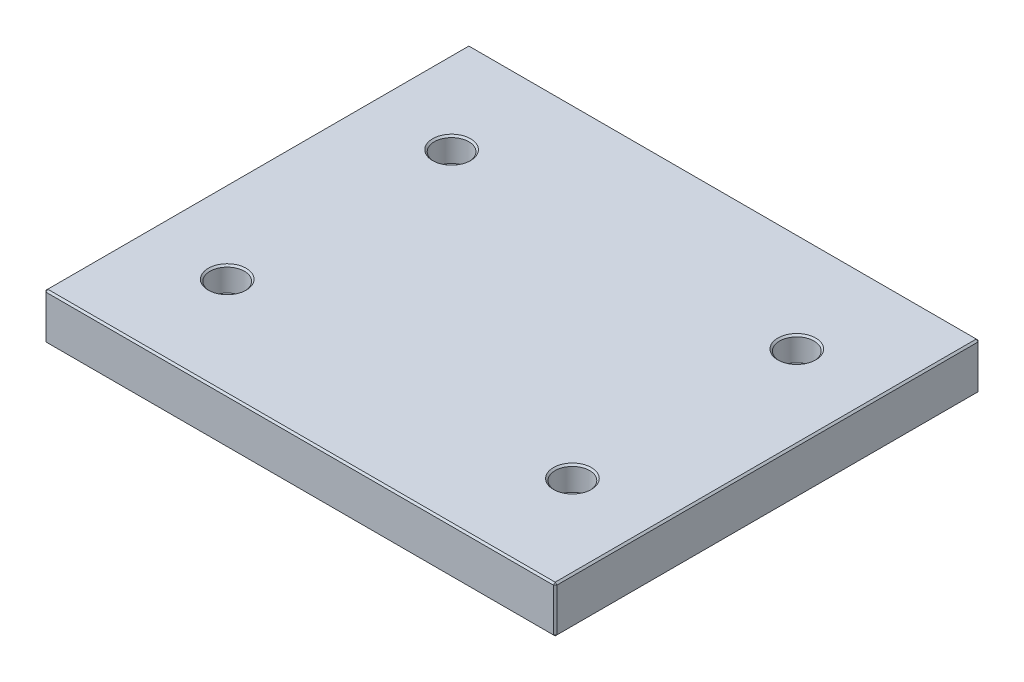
ISO-10303-21;
HEADER;
FILE_DESCRIPTION(('STEP AP214'),'2;1');
FILE_NAME('part.step','',(''),(''),'','','');
FILE_SCHEMA(('AUTOMOTIVE_DESIGN { 1 0 10303 214 1 1 1 1 }'));
ENDSEC;
DATA;
#1=APPLICATION_CONTEXT('core data for automotive mechanical design processes');
#2=APPLICATION_PROTOCOL_DEFINITION('international standard','automotive_design',2000,#1);
#3=PRODUCT_CONTEXT('',#1,'mechanical');
#4=PRODUCT('Part','Part','',(#3));
#5=PRODUCT_RELATED_PRODUCT_CATEGORY('part','',(#4));
#6=PRODUCT_DEFINITION_FORMATION('','',#4);
#7=PRODUCT_DEFINITION_CONTEXT('part definition',#1,'design');
#8=PRODUCT_DEFINITION('design','',#6,#7);
#9=PRODUCT_DEFINITION_SHAPE('','',#8);
#10=(LENGTH_UNIT() NAMED_UNIT(*) SI_UNIT(.MILLI.,.METRE.));
#11=(NAMED_UNIT(*) PLANE_ANGLE_UNIT() SI_UNIT($,.RADIAN.));
#12=(NAMED_UNIT(*) SI_UNIT($,.STERADIAN.) SOLID_ANGLE_UNIT());
#13=UNCERTAINTY_MEASURE_WITH_UNIT(LENGTH_MEASURE(1.E-05),#10,'distance_accuracy_value','');
#14=(GEOMETRIC_REPRESENTATION_CONTEXT(3) GLOBAL_UNCERTAINTY_ASSIGNED_CONTEXT((#13)) GLOBAL_UNIT_ASSIGNED_CONTEXT((#10,
#11,#12)) REPRESENTATION_CONTEXT('',''));
#15=CARTESIAN_POINT('',(0.,0.,0.));
#16=DIRECTION('',(0.,0.,1.));
#17=DIRECTION('',(1.,0.,0.));
#18=AXIS2_PLACEMENT_3D('',#15,#16,#17);
#19=CARTESIAN_POINT('',(-148.,27.,123.));
#20=DIRECTION('',(1.,0.,0.));
#21=DIRECTION('',(0.,0.,-1.));
#22=AXIS2_PLACEMENT_3D('',#19,#20,#21);
#23=PLANE('',#22);
#24=DIRECTION('',(0.,-1.,0.));
#25=VECTOR('',#24,1.);
#26=CARTESIAN_POINT('',(-148.,27.,-122.));
#27=LINE('',#26,#25);
#28=CARTESIAN_POINT('',(-148.,26.,-122.));
#29=VERTEX_POINT('',#28);
#30=CARTESIAN_POINT('',(-148.,1.,-122.));
#31=VERTEX_POINT('',#30);
#32=EDGE_CURVE('E115',#29,#31,#27,.T.);
#33=ORIENTED_EDGE('',*,*,#32,.T.);
#34=DIRECTION('',(0.,0.,1.));
#35=VECTOR('',#34,1.);
#36=CARTESIAN_POINT('',(-148.,1.,123.));
#37=LINE('',#36,#35);
#38=CARTESIAN_POINT('',(-148.,1.,122.));
#39=VERTEX_POINT('',#38);
#40=EDGE_CURVE('E111',#31,#39,#37,.T.);
#41=ORIENTED_EDGE('',*,*,#40,.T.);
#42=DIRECTION('',(0.,1.,0.));
#43=VECTOR('',#42,1.);
#44=CARTESIAN_POINT('',(-148.,27.,122.));
#45=LINE('',#44,#43);
#46=CARTESIAN_POINT('',(-148.,26.,122.));
#47=VERTEX_POINT('',#46);
#48=EDGE_CURVE('E104',#39,#47,#45,.T.);
#49=ORIENTED_EDGE('',*,*,#48,.T.);
#50=DIRECTION('',(0.,0.,-1.));
#51=VECTOR('',#50,1.);
#52=CARTESIAN_POINT('',(-148.,26.,-123.));
#53=LINE('',#52,#51);
#54=EDGE_CURVE('E108',#47,#29,#53,.T.);
#55=ORIENTED_EDGE('',*,*,#54,.T.);
#56=EDGE_LOOP('',(#33,#41,#49,#55));
#57=FACE_BOUND('',#56,.T.);
#58=ADVANCED_FACE('F16',(#57),#23,.F.);
#59=CARTESIAN_POINT('',(148.,27.,123.));
#60=DIRECTION('',(0.,0.,-1.));
#61=DIRECTION('',(-1.,0.,0.));
#62=AXIS2_PLACEMENT_3D('',#59,#60,#61);
#63=PLANE('',#62);
#64=DIRECTION('',(-1.,0.,0.));
#65=VECTOR('',#64,1.);
#66=CARTESIAN_POINT('',(-148.,26.,123.));
#67=LINE('',#66,#65);
#68=CARTESIAN_POINT('',(147.,26.,123.));
#69=VERTEX_POINT('',#68);
#70=CARTESIAN_POINT('',(-147.,26.,123.));
#71=VERTEX_POINT('',#70);
#72=EDGE_CURVE('E170',#69,#71,#67,.T.);
#73=ORIENTED_EDGE('',*,*,#72,.T.);
#74=DIRECTION('',(0.,-1.,0.));
#75=VECTOR('',#74,1.);
#76=CARTESIAN_POINT('',(-147.,27.,123.));
#77=LINE('',#76,#75);
#78=CARTESIAN_POINT('',(-147.,1.,123.));
#79=VERTEX_POINT('',#78);
#80=EDGE_CURVE('E123',#71,#79,#77,.T.);
#81=ORIENTED_EDGE('',*,*,#80,.T.);
#82=DIRECTION('',(1.,0.,0.));
#83=VECTOR('',#82,1.);
#84=CARTESIAN_POINT('',(148.,1.,123.));
#85=LINE('',#84,#83);
#86=CARTESIAN_POINT('',(147.,1.,123.));
#87=VERTEX_POINT('',#86);
#88=EDGE_CURVE('E174',#79,#87,#85,.T.);
#89=ORIENTED_EDGE('',*,*,#88,.T.);
#90=DIRECTION('',(0.,1.,0.));
#91=VECTOR('',#90,1.);
#92=CARTESIAN_POINT('',(147.,27.,123.));
#93=LINE('',#92,#91);
#94=EDGE_CURVE('E172',#87,#69,#93,.T.);
#95=ORIENTED_EDGE('',*,*,#94,.T.);
#96=EDGE_LOOP('',(#73,#81,#89,#95));
#97=FACE_BOUND('',#96,.T.);
#98=ADVANCED_FACE('F317',(#97),#63,.F.);
#99=CARTESIAN_POINT('',(148.,27.,123.));
#100=DIRECTION('',(-1.,0.,0.));
#101=DIRECTION('',(0.,0.,1.));
#102=AXIS2_PLACEMENT_3D('',#99,#100,#101);
#103=PLANE('',#102);
#104=DIRECTION('',(0.,0.,-1.));
#105=VECTOR('',#104,1.);
#106=CARTESIAN_POINT('',(148.,1.,123.));
#107=LINE('',#106,#105);
#108=CARTESIAN_POINT('',(148.,1.,122.));
#109=VERTEX_POINT('',#108);
#110=CARTESIAN_POINT('',(148.,1.,-122.));
#111=VERTEX_POINT('',#110);
#112=EDGE_CURVE('E165',#109,#111,#107,.T.);
#113=ORIENTED_EDGE('',*,*,#112,.T.);
#114=DIRECTION('',(0.,1.,0.));
#115=VECTOR('',#114,1.);
#116=CARTESIAN_POINT('',(148.,27.,-122.));
#117=LINE('',#116,#115);
#118=CARTESIAN_POINT('',(148.,26.,-122.));
#119=VERTEX_POINT('',#118);
#120=EDGE_CURVE('E167',#111,#119,#117,.T.);
#121=ORIENTED_EDGE('',*,*,#120,.T.);
#122=DIRECTION('',(0.,0.,1.));
#123=VECTOR('',#122,1.);
#124=CARTESIAN_POINT('',(148.,26.,123.));
#125=LINE('',#124,#123);
#126=CARTESIAN_POINT('',(148.,26.,122.));
#127=VERTEX_POINT('',#126);
#128=EDGE_CURVE('E161',#119,#127,#125,.T.);
#129=ORIENTED_EDGE('',*,*,#128,.T.);
#130=DIRECTION('',(0.,-1.,0.));
#131=VECTOR('',#130,1.);
#132=CARTESIAN_POINT('',(148.,27.,122.));
#133=LINE('',#132,#131);
#134=EDGE_CURVE('E163',#127,#109,#133,.T.);
#135=ORIENTED_EDGE('',*,*,#134,.T.);
#136=EDGE_LOOP('',(#113,#121,#129,#135));
#137=FACE_BOUND('',#136,.T.);
#138=ADVANCED_FACE('F323',(#137),#103,.F.);
#139=CARTESIAN_POINT('',(148.,27.,-123.));
#140=DIRECTION('',(0.,0.,1.));
#141=DIRECTION('',(1.,0.,0.));
#142=AXIS2_PLACEMENT_3D('',#139,#140,#141);
#143=PLANE('',#142);
#144=DIRECTION('',(0.,-1.,0.));
#145=VECTOR('',#144,1.);
#146=CARTESIAN_POINT('',(147.,27.,-123.));
#147=LINE('',#146,#145);
#148=CARTESIAN_POINT('',(147.,26.,-123.));
#149=VERTEX_POINT('',#148);
#150=CARTESIAN_POINT('',(147.,1.,-123.));
#151=VERTEX_POINT('',#150);
#152=EDGE_CURVE('E154',#149,#151,#147,.T.);
#153=ORIENTED_EDGE('',*,*,#152,.T.);
#154=DIRECTION('',(-1.,0.,0.));
#155=VECTOR('',#154,1.);
#156=CARTESIAN_POINT('',(148.,1.,-123.));
#157=LINE('',#156,#155);
#158=CARTESIAN_POINT('',(-147.,1.,-123.));
#159=VERTEX_POINT('',#158);
#160=EDGE_CURVE('E159',#151,#159,#157,.T.);
#161=ORIENTED_EDGE('',*,*,#160,.T.);
#162=DIRECTION('',(0.,1.,0.));
#163=VECTOR('',#162,1.);
#164=CARTESIAN_POINT('',(-147.,27.,-123.));
#165=LINE('',#164,#163);
#166=CARTESIAN_POINT('',(-147.,26.,-123.));
#167=VERTEX_POINT('',#166);
#168=EDGE_CURVE('E156',#159,#167,#165,.T.);
#169=ORIENTED_EDGE('',*,*,#168,.T.);
#170=DIRECTION('',(1.,0.,0.));
#171=VECTOR('',#170,1.);
#172=CARTESIAN_POINT('',(148.,26.,-123.));
#173=LINE('',#172,#171);
#174=EDGE_CURVE('E152',#167,#149,#173,.T.);
#175=ORIENTED_EDGE('',*,*,#174,.T.);
#176=EDGE_LOOP('',(#153,#161,#169,#175));
#177=FACE_BOUND('',#176,.T.);
#178=ADVANCED_FACE('F465',(#177),#143,.F.);
#179=CARTESIAN_POINT('',(0.,27.,0.));
#180=DIRECTION('',(0.,1.,0.));
#181=DIRECTION('',(0.,0.,1.));
#182=AXIS2_PLACEMENT_3D('',#179,#180,#181);
#183=PLANE('',#182);
#184=CARTESIAN_POINT('',(-100.,27.,65.));
#185=DIRECTION('',(0.,1.,0.));
#186=DIRECTION('',(0.,0.,1.));
#187=AXIS2_PLACEMENT_3D('',#184,#185,#186);
#188=CIRCLE('',#187,11.);
#189=CARTESIAN_POINT('',(-100.,27.,76.));
#190=VERTEX_POINT('',#189);
#191=EDGE_CURVE('E290',#190,#190,#188,.F.);
#192=ORIENTED_EDGE('',*,*,#191,.T.);
#193=EDGE_LOOP('',(#192));
#194=FACE_BOUND('',#193,.T.);
#195=CARTESIAN_POINT('',(100.,27.,65.));
#196=DIRECTION('',(0.,1.,0.));
#197=DIRECTION('',(0.,0.,1.));
#198=AXIS2_PLACEMENT_3D('',#195,#196,#197);
#199=CIRCLE('',#198,11.);
#200=CARTESIAN_POINT('',(100.,27.,76.));
#201=VERTEX_POINT('',#200);
#202=EDGE_CURVE('E287',#201,#201,#199,.F.);
#203=ORIENTED_EDGE('',*,*,#202,.T.);
#204=EDGE_LOOP('',(#203));
#205=FACE_BOUND('',#204,.T.);
#206=CARTESIAN_POINT('',(100.,27.,-65.));
#207=DIRECTION('',(0.,1.,0.));
#208=DIRECTION('',(0.,0.,1.));
#209=AXIS2_PLACEMENT_3D('',#206,#207,#208);
#210=CIRCLE('',#209,11.);
#211=CARTESIAN_POINT('',(100.,27.,-54.));
#212=VERTEX_POINT('',#211);
#213=EDGE_CURVE('E284',#212,#212,#210,.F.);
#214=ORIENTED_EDGE('',*,*,#213,.T.);
#215=EDGE_LOOP('',(#214));
#216=FACE_BOUND('',#215,.T.);
#217=CARTESIAN_POINT('',(-100.,27.,-65.));
#218=DIRECTION('',(0.,1.,0.));
#219=DIRECTION('',(0.,0.,1.));
#220=AXIS2_PLACEMENT_3D('',#217,#218,#219);
#221=CIRCLE('',#220,11.);
#222=CARTESIAN_POINT('',(-100.,27.,-54.));
#223=VERTEX_POINT('',#222);
#224=EDGE_CURVE('E281',#223,#223,#221,.F.);
#225=ORIENTED_EDGE('',*,*,#224,.T.);
#226=EDGE_LOOP('',(#225));
#227=FACE_BOUND('',#226,.T.);
#228=DIRECTION('',(0.,0.,-1.));
#229=VECTOR('',#228,1.);
#230=CARTESIAN_POINT('',(147.,27.,-123.));
#231=LINE('',#230,#229);
#232=CARTESIAN_POINT('',(147.,27.,122.));
#233=VERTEX_POINT('',#232);
#234=CARTESIAN_POINT('',(147.,27.,-122.));
#235=VERTEX_POINT('',#234);
#236=EDGE_CURVE('E31',#233,#235,#231,.T.);
#237=ORIENTED_EDGE('',*,*,#236,.T.);
#238=DIRECTION('',(-1.,0.,0.));
#239=VECTOR('',#238,1.);
#240=CARTESIAN_POINT('',(-148.,27.,-122.));
#241=LINE('',#240,#239);
#242=CARTESIAN_POINT('',(-147.,27.,-122.));
#243=VERTEX_POINT('',#242);
#244=EDGE_CURVE('E190',#235,#243,#241,.T.);
#245=ORIENTED_EDGE('',*,*,#244,.T.);
#246=DIRECTION('',(0.,0.,1.));
#247=VECTOR('',#246,1.);
#248=CARTESIAN_POINT('',(-147.,27.,123.));
#249=LINE('',#248,#247);
#250=CARTESIAN_POINT('',(-147.,27.,122.));
#251=VERTEX_POINT('',#250);
#252=EDGE_CURVE('E186',#243,#251,#249,.T.);
#253=ORIENTED_EDGE('',*,*,#252,.T.);
#254=DIRECTION('',(1.,0.,0.));
#255=VECTOR('',#254,1.);
#256=CARTESIAN_POINT('',(148.,27.,122.));
#257=LINE('',#256,#255);
#258=EDGE_CURVE('E36',#251,#233,#257,.T.);
#259=ORIENTED_EDGE('',*,*,#258,.T.);
#260=EDGE_LOOP('',(#237,#245,#253,#259));
#261=FACE_BOUND('',#260,.T.);
#262=ADVANCED_FACE('F462',(#194,#205,#216,#227,#261),#183,.T.);
#263=CARTESIAN_POINT('',(0.,0.,0.));
#264=DIRECTION('',(0.,1.,0.));
#265=DIRECTION('',(0.,0.,1.));
#266=AXIS2_PLACEMENT_3D('',#263,#264,#265);
#267=PLANE('',#266);
#268=CARTESIAN_POINT('',(100.,0.,-65.));
#269=DIRECTION('',(0.,1.,0.));
#270=DIRECTION('',(0.,0.,1.));
#271=AXIS2_PLACEMENT_3D('',#268,#269,#270);
#272=CIRCLE('',#271,8.);
#273=CARTESIAN_POINT('',(100.,0.,-57.));
#274=VERTEX_POINT('',#273);
#275=EDGE_CURVE('E263',#274,#274,#272,.T.);
#276=ORIENTED_EDGE('',*,*,#275,.T.);
#277=EDGE_LOOP('',(#276));
#278=FACE_BOUND('',#277,.T.);
#279=CARTESIAN_POINT('',(100.,0.,65.));
#280=DIRECTION('',(0.,1.,0.));
#281=DIRECTION('',(0.,0.,1.));
#282=AXIS2_PLACEMENT_3D('',#279,#280,#281);
#283=CIRCLE('',#282,8.);
#284=CARTESIAN_POINT('',(100.,0.,73.));
#285=VERTEX_POINT('',#284);
#286=EDGE_CURVE('E260',#285,#285,#283,.T.);
#287=ORIENTED_EDGE('',*,*,#286,.T.);
#288=EDGE_LOOP('',(#287));
#289=FACE_BOUND('',#288,.T.);
#290=CARTESIAN_POINT('',(-100.,0.,65.));
#291=DIRECTION('',(0.,1.,0.));
#292=DIRECTION('',(0.,0.,1.));
#293=AXIS2_PLACEMENT_3D('',#290,#291,#292);
#294=CIRCLE('',#293,8.);
#295=CARTESIAN_POINT('',(-100.,0.,73.));
#296=VERTEX_POINT('',#295);
#297=EDGE_CURVE('E257',#296,#296,#294,.T.);
#298=ORIENTED_EDGE('',*,*,#297,.T.);
#299=EDGE_LOOP('',(#298));
#300=FACE_BOUND('',#299,.T.);
#301=CARTESIAN_POINT('',(-100.,0.,-65.));
#302=DIRECTION('',(0.,1.,0.));
#303=DIRECTION('',(0.,0.,1.));
#304=AXIS2_PLACEMENT_3D('',#301,#302,#303);
#305=CIRCLE('',#304,8.);
#306=CARTESIAN_POINT('',(-100.,0.,-57.));
#307=VERTEX_POINT('',#306);
#308=EDGE_CURVE('E192',#307,#307,#305,.T.);
#309=ORIENTED_EDGE('',*,*,#308,.T.);
#310=EDGE_LOOP('',(#309));
#311=FACE_BOUND('',#310,.T.);
#312=DIRECTION('',(0.,0.,1.));
#313=VECTOR('',#312,1.);
#314=CARTESIAN_POINT('',(147.,0.,0.));
#315=LINE('',#314,#313);
#316=CARTESIAN_POINT('',(147.,0.,-122.));
#317=VERTEX_POINT('',#316);
#318=CARTESIAN_POINT('',(147.,0.,122.));
#319=VERTEX_POINT('',#318);
#320=EDGE_CURVE('E177',#317,#319,#315,.T.);
#321=ORIENTED_EDGE('',*,*,#320,.T.);
#322=DIRECTION('',(-1.,0.,0.));
#323=VECTOR('',#322,1.);
#324=CARTESIAN_POINT('',(0.,0.,122.));
#325=LINE('',#324,#323);
#326=CARTESIAN_POINT('',(-147.,0.,122.));
#327=VERTEX_POINT('',#326);
#328=EDGE_CURVE('E183',#319,#327,#325,.T.);
#329=ORIENTED_EDGE('',*,*,#328,.T.);
#330=DIRECTION('',(0.,0.,-1.));
#331=VECTOR('',#330,1.);
#332=CARTESIAN_POINT('',(-147.,0.,0.));
#333=LINE('',#332,#331);
#334=CARTESIAN_POINT('',(-147.,0.,-122.));
#335=VERTEX_POINT('',#334);
#336=EDGE_CURVE('E181',#327,#335,#333,.T.);
#337=ORIENTED_EDGE('',*,*,#336,.T.);
#338=DIRECTION('',(1.,0.,0.));
#339=VECTOR('',#338,1.);
#340=CARTESIAN_POINT('',(0.,0.,-122.));
#341=LINE('',#340,#339);
#342=EDGE_CURVE('E179',#335,#317,#341,.T.);
#343=ORIENTED_EDGE('',*,*,#342,.T.);
#344=EDGE_LOOP('',(#321,#329,#337,#343));
#345=FACE_BOUND('',#344,.T.);
#346=ADVANCED_FACE('F402',(#278,#289,#300,#311,#345),#267,.F.);
#347=CARTESIAN_POINT('',(148.,27.,122.));
#348=DIRECTION('',(-0.707106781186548,0.,-0.707106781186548));
#349=DIRECTION('',(0.,-1.,0.));
#350=AXIS2_PLACEMENT_3D('',#347,#348,#349);
#351=PLANE('',#350);
#352=DIRECTION('',(-0.707106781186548,0.,0.707106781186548));
#353=VECTOR('',#352,1.);
#354=CARTESIAN_POINT('',(147.,26.,123.));
#355=LINE('',#354,#353);
#356=EDGE_CURVE('E141',#69,#127,#355,.F.);
#357=ORIENTED_EDGE('',*,*,#356,.F.);
#358=ORIENTED_EDGE('',*,*,#94,.F.);
#359=DIRECTION('',(0.707106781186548,0.,-0.707106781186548));
#360=VECTOR('',#359,1.);
#361=CARTESIAN_POINT('',(147.,1.,123.));
#362=LINE('',#361,#360);
#363=EDGE_CURVE('E144',#109,#87,#362,.F.);
#364=ORIENTED_EDGE('',*,*,#363,.F.);
#365=ORIENTED_EDGE('',*,*,#134,.F.);
#366=EDGE_LOOP('',(#357,#358,#364,#365));
#367=FACE_BOUND('',#366,.T.);
#368=ADVANCED_FACE('F398',(#367),#351,.F.);
#369=CARTESIAN_POINT('',(147.,26.,123.));
#370=DIRECTION('',(0.577350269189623,0.577350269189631,0.577350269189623));
#371=DIRECTION('',(0.,-0.707106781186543,0.707106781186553));
#372=AXIS2_PLACEMENT_3D('',#369,#370,#371);
#373=PLANE('',#372);
#374=DIRECTION('',(0.,-0.70710678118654,0.707106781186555));
#375=VECTOR('',#374,1.);
#376=CARTESIAN_POINT('',(147.,26.,123.));
#377=LINE('',#376,#375);
#378=EDGE_CURVE('E235',#69,#233,#377,.F.);
#379=ORIENTED_EDGE('',*,*,#378,.F.);
#380=ORIENTED_EDGE('',*,*,#356,.T.);
#381=DIRECTION('',(-0.707106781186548,0.707106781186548,0.));
#382=VECTOR('',#381,1.);
#383=CARTESIAN_POINT('',(147.5,26.5,122.));
#384=LINE('',#383,#382);
#385=EDGE_CURVE('E237',#233,#127,#384,.F.);
#386=ORIENTED_EDGE('',*,*,#385,.F.);
#387=EDGE_LOOP('',(#379,#380,#386));
#388=FACE_BOUND('',#387,.T.);
#389=ADVANCED_FACE('F394',(#388),#373,.T.);
#390=CARTESIAN_POINT('',(147.,1.,123.));
#391=DIRECTION('',(0.577350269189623,-0.577350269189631,0.577350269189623));
#392=DIRECTION('',(0.,-0.707106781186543,-0.707106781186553));
#393=AXIS2_PLACEMENT_3D('',#390,#391,#392);
#394=PLANE('',#393);
#395=DIRECTION('',(-0.707106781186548,-0.707106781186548,0.));
#396=VECTOR('',#395,1.);
#397=CARTESIAN_POINT('',(147.5,0.500000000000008,122.));
#398=LINE('',#397,#396);
#399=EDGE_CURVE('E229',#109,#319,#398,.T.);
#400=ORIENTED_EDGE('',*,*,#399,.F.);
#401=ORIENTED_EDGE('',*,*,#363,.T.);
#402=DIRECTION('',(0.,0.70710678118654,0.707106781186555));
#403=VECTOR('',#402,1.);
#404=CARTESIAN_POINT('',(147.,1.,123.));
#405=LINE('',#404,#403);
#406=EDGE_CURVE('E232',#319,#87,#405,.T.);
#407=ORIENTED_EDGE('',*,*,#406,.F.);
#408=EDGE_LOOP('',(#400,#401,#407));
#409=FACE_BOUND('',#408,.T.);
#410=ADVANCED_FACE('F390',(#409),#394,.T.);
#411=CARTESIAN_POINT('',(147.,27.,0.));
#412=DIRECTION('',(0.707106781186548,0.707106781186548,0.));
#413=DIRECTION('',(0.,0.,1.));
#414=AXIS2_PLACEMENT_3D('',#411,#412,#413);
#415=PLANE('',#414);
#416=ORIENTED_EDGE('',*,*,#385,.T.);
#417=ORIENTED_EDGE('',*,*,#128,.F.);
#418=DIRECTION('',(0.707106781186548,-0.707106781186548,0.));
#419=VECTOR('',#418,1.);
#420=CARTESIAN_POINT('',(148.,26.,-122.));
#421=LINE('',#420,#419);
#422=EDGE_CURVE('E224',#235,#119,#421,.T.);
#423=ORIENTED_EDGE('',*,*,#422,.F.);
#424=ORIENTED_EDGE('',*,*,#236,.F.);
#425=EDGE_LOOP('',(#416,#417,#423,#424));
#426=FACE_BOUND('',#425,.T.);
#427=ADVANCED_FACE('F386',(#426),#415,.T.);
#428=CARTESIAN_POINT('',(0.,27.,122.));
#429=DIRECTION('',(0.,0.707106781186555,0.70710678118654));
#430=DIRECTION('',(-1.,0.,0.));
#431=AXIS2_PLACEMENT_3D('',#428,#429,#430);
#432=PLANE('',#431);
#433=ORIENTED_EDGE('',*,*,#378,.T.);
#434=ORIENTED_EDGE('',*,*,#258,.F.);
#435=DIRECTION('',(0.,0.70710678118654,-0.707106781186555));
#436=VECTOR('',#435,1.);
#437=CARTESIAN_POINT('',(-147.,26.5,122.5));
#438=LINE('',#437,#436);
#439=EDGE_CURVE('E127',#71,#251,#438,.T.);
#440=ORIENTED_EDGE('',*,*,#439,.F.);
#441=ORIENTED_EDGE('',*,*,#72,.F.);
#442=EDGE_LOOP('',(#433,#434,#440,#441));
#443=FACE_BOUND('',#442,.T.);
#444=ADVANCED_FACE('F383',(#443),#432,.T.);
#445=CARTESIAN_POINT('',(-147.,27.,123.));
#446=DIRECTION('',(0.707106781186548,0.,-0.707106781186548));
#447=DIRECTION('',(0.,-1.,0.));
#448=AXIS2_PLACEMENT_3D('',#445,#446,#447);
#449=PLANE('',#448);
#450=DIRECTION('',(0.707106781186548,0.,0.707106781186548));
#451=VECTOR('',#450,1.);
#452=CARTESIAN_POINT('',(-147.,1.,123.));
#453=LINE('',#452,#451);
#454=EDGE_CURVE('E128',#79,#39,#453,.F.);
#455=ORIENTED_EDGE('',*,*,#454,.F.);
#456=ORIENTED_EDGE('',*,*,#80,.F.);
#457=DIRECTION('',(-0.707106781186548,0.,-0.707106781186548));
#458=VECTOR('',#457,1.);
#459=CARTESIAN_POINT('',(-148.,26.,122.));
#460=LINE('',#459,#458);
#461=EDGE_CURVE('E119',#47,#71,#460,.F.);
#462=ORIENTED_EDGE('',*,*,#461,.F.);
#463=ORIENTED_EDGE('',*,*,#48,.F.);
#464=EDGE_LOOP('',(#455,#456,#462,#463));
#465=FACE_BOUND('',#464,.T.);
#466=ADVANCED_FACE('F121',(#465),#449,.F.);
#467=CARTESIAN_POINT('',(148.,1.,123.));
#468=DIRECTION('',(0.,0.707106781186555,-0.70710678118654));
#469=DIRECTION('',(1.,0.,0.));
#470=AXIS2_PLACEMENT_3D('',#467,#468,#469);
#471=PLANE('',#470);
#472=ORIENTED_EDGE('',*,*,#406,.T.);
#473=ORIENTED_EDGE('',*,*,#88,.F.);
#474=DIRECTION('',(0.,-0.70710678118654,-0.707106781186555));
#475=VECTOR('',#474,1.);
#476=CARTESIAN_POINT('',(-147.,1.,123.));
#477=LINE('',#476,#475);
#478=EDGE_CURVE('E220',#327,#79,#477,.F.);
#479=ORIENTED_EDGE('',*,*,#478,.F.);
#480=ORIENTED_EDGE('',*,*,#328,.F.);
#481=EDGE_LOOP('',(#472,#473,#479,#480));
#482=FACE_BOUND('',#481,.T.);
#483=ADVANCED_FACE('F376',(#482),#471,.F.);
#484=CARTESIAN_POINT('',(148.,1.,123.));
#485=DIRECTION('',(-0.707106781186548,0.707106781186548,0.));
#486=DIRECTION('',(0.,0.,-1.));
#487=AXIS2_PLACEMENT_3D('',#484,#485,#486);
#488=PLANE('',#487);
#489=ORIENTED_EDGE('',*,*,#399,.T.);
#490=ORIENTED_EDGE('',*,*,#320,.F.);
#491=DIRECTION('',(0.707106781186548,0.707106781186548,0.));
#492=VECTOR('',#491,1.);
#493=CARTESIAN_POINT('',(147.5,0.499999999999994,-122.));
#494=LINE('',#493,#492);
#495=EDGE_CURVE('E217',#111,#317,#494,.F.);
#496=ORIENTED_EDGE('',*,*,#495,.F.);
#497=ORIENTED_EDGE('',*,*,#112,.F.);
#498=EDGE_LOOP('',(#489,#490,#496,#497));
#499=FACE_BOUND('',#498,.T.);
#500=ADVANCED_FACE('F372',(#499),#488,.F.);
#501=CARTESIAN_POINT('',(147.,27.,-123.));
#502=DIRECTION('',(-0.707106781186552,0.,0.707106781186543));
#503=DIRECTION('',(0.,-1.,0.));
#504=AXIS2_PLACEMENT_3D('',#501,#502,#503);
#505=PLANE('',#504);
#506=DIRECTION('',(0.707106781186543,0.,0.707106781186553));
#507=VECTOR('',#506,1.);
#508=CARTESIAN_POINT('',(148.,26.,-122.));
#509=LINE('',#508,#507);
#510=EDGE_CURVE('E226',#119,#149,#509,.F.);
#511=ORIENTED_EDGE('',*,*,#510,.F.);
#512=ORIENTED_EDGE('',*,*,#120,.F.);
#513=DIRECTION('',(-0.707106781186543,0.,-0.707106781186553));
#514=VECTOR('',#513,1.);
#515=CARTESIAN_POINT('',(147.,1.,-123.));
#516=LINE('',#515,#514);
#517=EDGE_CURVE('E214',#151,#111,#516,.F.);
#518=ORIENTED_EDGE('',*,*,#517,.F.);
#519=ORIENTED_EDGE('',*,*,#152,.F.);
#520=EDGE_LOOP('',(#511,#512,#518,#519));
#521=FACE_BOUND('',#520,.T.);
#522=ADVANCED_FACE('F368',(#521),#505,.F.);
#523=CARTESIAN_POINT('',(148.,26.,-122.));
#524=DIRECTION('',(0.577350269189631,0.577350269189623,-0.577350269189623));
#525=DIRECTION('',(-0.707106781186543,0.,-0.707106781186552));
#526=AXIS2_PLACEMENT_3D('',#523,#524,#525);
#527=PLANE('',#526);
#528=ORIENTED_EDGE('',*,*,#422,.T.);
#529=ORIENTED_EDGE('',*,*,#510,.T.);
#530=DIRECTION('',(0.,0.707106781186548,0.707106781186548));
#531=VECTOR('',#530,1.);
#532=CARTESIAN_POINT('',(147.,26.5,-122.5));
#533=LINE('',#532,#531);
#534=EDGE_CURVE('E135',#235,#149,#533,.F.);
#535=ORIENTED_EDGE('',*,*,#534,.F.);
#536=EDGE_LOOP('',(#528,#529,#535));
#537=FACE_BOUND('',#536,.T.);
#538=ADVANCED_FACE('F365',(#537),#527,.T.);
#539=CARTESIAN_POINT('',(-148.,26.,122.));
#540=DIRECTION('',(-0.577350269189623,0.577350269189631,0.577350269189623));
#541=DIRECTION('',(0.,-0.707106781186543,0.707106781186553));
#542=AXIS2_PLACEMENT_3D('',#539,#540,#541);
#543=PLANE('',#542);
#544=ORIENTED_EDGE('',*,*,#461,.T.);
#545=ORIENTED_EDGE('',*,*,#439,.T.);
#546=DIRECTION('',(-0.707106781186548,-0.707106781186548,0.));
#547=VECTOR('',#546,1.);
#548=CARTESIAN_POINT('',(-148.,26.,122.));
#549=LINE('',#548,#547);
#550=EDGE_CURVE('E131',#47,#251,#549,.F.);
#551=ORIENTED_EDGE('',*,*,#550,.F.);
#552=EDGE_LOOP('',(#544,#545,#551));
#553=FACE_BOUND('',#552,.T.);
#554=ADVANCED_FACE('F132',(#553),#543,.T.);
#555=CARTESIAN_POINT('',(-147.,1.,123.));
#556=DIRECTION('',(-0.577350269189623,-0.577350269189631,0.577350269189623));
#557=DIRECTION('',(0.,-0.707106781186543,-0.707106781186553));
#558=AXIS2_PLACEMENT_3D('',#555,#556,#557);
#559=PLANE('',#558);
#560=ORIENTED_EDGE('',*,*,#478,.T.);
#561=ORIENTED_EDGE('',*,*,#454,.T.);
#562=DIRECTION('',(-0.707106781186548,0.707106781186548,0.));
#563=VECTOR('',#562,1.);
#564=CARTESIAN_POINT('',(-147.5,0.500000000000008,122.));
#565=LINE('',#564,#563);
#566=EDGE_CURVE('E136',#327,#39,#565,.T.);
#567=ORIENTED_EDGE('',*,*,#566,.F.);
#568=EDGE_LOOP('',(#560,#561,#567));
#569=FACE_BOUND('',#568,.T.);
#570=ADVANCED_FACE('F358',(#569),#559,.T.);
#571=CARTESIAN_POINT('',(147.,1.,-123.));
#572=DIRECTION('',(0.577350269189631,-0.577350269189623,-0.577350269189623));
#573=DIRECTION('',(-0.707106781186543,0.,-0.707106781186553));
#574=AXIS2_PLACEMENT_3D('',#571,#572,#573);
#575=PLANE('',#574);
#576=ORIENTED_EDGE('',*,*,#517,.T.);
#577=ORIENTED_EDGE('',*,*,#495,.T.);
#578=DIRECTION('',(0.,-0.707106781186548,0.707106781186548));
#579=VECTOR('',#578,1.);
#580=CARTESIAN_POINT('',(147.,1.,-123.));
#581=LINE('',#580,#579);
#582=EDGE_CURVE('E207',#151,#317,#581,.T.);
#583=ORIENTED_EDGE('',*,*,#582,.F.);
#584=EDGE_LOOP('',(#576,#577,#583));
#585=FACE_BOUND('',#584,.T.);
#586=ADVANCED_FACE('F354',(#585),#575,.T.);
#587=CARTESIAN_POINT('',(0.,27.,-122.));
#588=DIRECTION('',(0.,0.707106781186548,-0.707106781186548));
#589=DIRECTION('',(1.,0.,0.));
#590=AXIS2_PLACEMENT_3D('',#587,#588,#589);
#591=PLANE('',#590);
#592=ORIENTED_EDGE('',*,*,#534,.T.);
#593=ORIENTED_EDGE('',*,*,#174,.F.);
#594=DIRECTION('',(0.,-0.707106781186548,-0.707106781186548));
#595=VECTOR('',#594,1.);
#596=CARTESIAN_POINT('',(-147.,26.,-123.));
#597=LINE('',#596,#595);
#598=EDGE_CURVE('E204',#243,#167,#597,.T.);
#599=ORIENTED_EDGE('',*,*,#598,.F.);
#600=ORIENTED_EDGE('',*,*,#244,.F.);
#601=EDGE_LOOP('',(#592,#593,#599,#600));
#602=FACE_BOUND('',#601,.T.);
#603=ADVANCED_FACE('F351',(#602),#591,.T.);
#604=CARTESIAN_POINT('',(-147.,27.,0.));
#605=DIRECTION('',(-0.707106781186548,0.707106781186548,0.));
#606=DIRECTION('',(0.,0.,-1.));
#607=AXIS2_PLACEMENT_3D('',#604,#605,#606);
#608=PLANE('',#607);
#609=ORIENTED_EDGE('',*,*,#550,.T.);
#610=ORIENTED_EDGE('',*,*,#252,.F.);
#611=DIRECTION('',(0.707106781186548,0.707106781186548,0.));
#612=VECTOR('',#611,1.);
#613=CARTESIAN_POINT('',(-147.5,26.5,-122.));
#614=LINE('',#613,#612);
#615=EDGE_CURVE('E139',#29,#243,#614,.T.);
#616=ORIENTED_EDGE('',*,*,#615,.F.);
#617=ORIENTED_EDGE('',*,*,#54,.F.);
#618=EDGE_LOOP('',(#609,#610,#616,#617));
#619=FACE_BOUND('',#618,.T.);
#620=ADVANCED_FACE('F138',(#619),#608,.T.);
#621=CARTESIAN_POINT('',(-148.,1.,123.));
#622=DIRECTION('',(0.707106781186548,0.707106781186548,0.));
#623=DIRECTION('',(0.,0.,1.));
#624=AXIS2_PLACEMENT_3D('',#621,#622,#623);
#625=PLANE('',#624);
#626=ORIENTED_EDGE('',*,*,#566,.T.);
#627=ORIENTED_EDGE('',*,*,#40,.F.);
#628=DIRECTION('',(0.707106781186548,-0.707106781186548,0.));
#629=VECTOR('',#628,1.);
#630=CARTESIAN_POINT('',(-148.,1.,-122.));
#631=LINE('',#630,#629);
#632=EDGE_CURVE('E200',#335,#31,#631,.F.);
#633=ORIENTED_EDGE('',*,*,#632,.F.);
#634=ORIENTED_EDGE('',*,*,#336,.F.);
#635=EDGE_LOOP('',(#626,#627,#633,#634));
#636=FACE_BOUND('',#635,.T.);
#637=ADVANCED_FACE('F344',(#636),#625,.F.);
#638=CARTESIAN_POINT('',(148.,1.,-123.));
#639=DIRECTION('',(0.,0.707106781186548,0.707106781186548));
#640=DIRECTION('',(-1.,0.,0.));
#641=AXIS2_PLACEMENT_3D('',#638,#639,#640);
#642=PLANE('',#641);
#643=ORIENTED_EDGE('',*,*,#582,.T.);
#644=ORIENTED_EDGE('',*,*,#342,.F.);
#645=DIRECTION('',(0.,0.707106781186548,-0.707106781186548));
#646=VECTOR('',#645,1.);
#647=CARTESIAN_POINT('',(-147.,0.5,-122.5));
#648=LINE('',#647,#646);
#649=EDGE_CURVE('E197',#159,#335,#648,.F.);
#650=ORIENTED_EDGE('',*,*,#649,.F.);
#651=ORIENTED_EDGE('',*,*,#160,.F.);
#652=EDGE_LOOP('',(#643,#644,#650,#651));
#653=FACE_BOUND('',#652,.T.);
#654=ADVANCED_FACE('F340',(#653),#642,.F.);
#655=CARTESIAN_POINT('',(-147.,26.,-123.));
#656=DIRECTION('',(-0.577350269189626,0.577350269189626,-0.577350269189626));
#657=DIRECTION('',(-0.707106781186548,0.,0.707106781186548));
#658=AXIS2_PLACEMENT_3D('',#655,#656,#657);
#659=PLANE('',#658);
#660=ORIENTED_EDGE('',*,*,#615,.T.);
#661=ORIENTED_EDGE('',*,*,#598,.T.);
#662=DIRECTION('',(0.707106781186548,0.,-0.707106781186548));
#663=VECTOR('',#662,1.);
#664=CARTESIAN_POINT('',(-147.,26.,-123.));
#665=LINE('',#664,#663);
#666=EDGE_CURVE('E195',#29,#167,#665,.T.);
#667=ORIENTED_EDGE('',*,*,#666,.F.);
#668=EDGE_LOOP('',(#660,#661,#667));
#669=FACE_BOUND('',#668,.T.);
#670=ADVANCED_FACE('F336',(#669),#659,.T.);
#671=CARTESIAN_POINT('',(-148.,1.,-122.));
#672=DIRECTION('',(-0.577350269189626,-0.577350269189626,-0.577350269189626));
#673=DIRECTION('',(-0.707106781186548,0.,0.707106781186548));
#674=AXIS2_PLACEMENT_3D('',#671,#672,#673);
#675=PLANE('',#674);
#676=ORIENTED_EDGE('',*,*,#649,.T.);
#677=ORIENTED_EDGE('',*,*,#632,.T.);
#678=DIRECTION('',(-0.707106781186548,0.,0.707106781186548));
#679=VECTOR('',#678,1.);
#680=CARTESIAN_POINT('',(-148.,1.,-122.));
#681=LINE('',#680,#679);
#682=EDGE_CURVE('E193',#159,#31,#681,.T.);
#683=ORIENTED_EDGE('',*,*,#682,.F.);
#684=EDGE_LOOP('',(#676,#677,#683));
#685=FACE_BOUND('',#684,.T.);
#686=ADVANCED_FACE('F332',(#685),#675,.T.);
#687=CARTESIAN_POINT('',(-148.,27.,-122.));
#688=DIRECTION('',(0.707106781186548,0.,0.707106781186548));
#689=DIRECTION('',(0.,-1.,0.));
#690=AXIS2_PLACEMENT_3D('',#687,#688,#689);
#691=PLANE('',#690);
#692=ORIENTED_EDGE('',*,*,#666,.T.);
#693=ORIENTED_EDGE('',*,*,#168,.F.);
#694=ORIENTED_EDGE('',*,*,#682,.T.);
#695=ORIENTED_EDGE('',*,*,#32,.F.);
#696=EDGE_LOOP('',(#692,#693,#694,#695));
#697=FACE_BOUND('',#696,.T.);
#698=ADVANCED_FACE('F328',(#697),#691,.F.);
#699=CARTESIAN_POINT('',(-100.,13.,-65.));
#700=DIRECTION('',(0.,1.,0.));
#701=DIRECTION('',(0.,0.,1.));
#702=AXIS2_PLACEMENT_3D('',#699,#700,#701);
#703=CYLINDRICAL_SURFACE('',#702,10.);
#704=CARTESIAN_POINT('',(-100.,26.,-65.));
#705=DIRECTION('',(0.,1.,0.));
#706=DIRECTION('',(0.,0.,1.));
#707=AXIS2_PLACEMENT_3D('',#704,#705,#706);
#708=CIRCLE('',#707,10.);
#709=CARTESIAN_POINT('',(-100.,26.,-55.));
#710=VERTEX_POINT('',#709);
#711=EDGE_CURVE('E10',#710,#710,#708,.T.);
#712=ORIENTED_EDGE('',*,*,#711,.T.);
#713=EDGE_LOOP('',(#712));
#714=FACE_BOUND('',#713,.T.);
#715=CARTESIAN_POINT('',(-100.,13.,-65.));
#716=DIRECTION('',(0.,1.,0.));
#717=DIRECTION('',(0.,0.,1.));
#718=AXIS2_PLACEMENT_3D('',#715,#716,#717);
#719=CIRCLE('',#718,10.);
#720=CARTESIAN_POINT('',(-100.,13.,-55.));
#721=VERTEX_POINT('',#720);
#722=EDGE_CURVE('E147',#721,#721,#719,.T.);
#723=ORIENTED_EDGE('',*,*,#722,.F.);
#724=EDGE_LOOP('',(#723));
#725=FACE_BOUND('',#724,.T.);
#726=ADVANCED_FACE('F331',(#714,#725),#703,.F.);
#727=CARTESIAN_POINT('',(-100.,13.,-65.));
#728=DIRECTION('',(0.,1.,0.));
#729=DIRECTION('',(0.,0.,1.));
#730=AXIS2_PLACEMENT_3D('',#727,#728,#729);
#731=PLANE('',#730);
#732=CARTESIAN_POINT('',(-100.,13.,-65.));
#733=DIRECTION('',(0.,1.,0.));
#734=DIRECTION('',(0.,0.,1.));
#735=AXIS2_PLACEMENT_3D('',#732,#733,#734);
#736=CIRCLE('',#735,7.);
#737=CARTESIAN_POINT('',(-100.,13.,-58.));
#738=VERTEX_POINT('',#737);
#739=EDGE_CURVE('E251',#738,#738,#736,.T.);
#740=ORIENTED_EDGE('',*,*,#739,.F.);
#741=EDGE_LOOP('',(#740));
#742=FACE_BOUND('',#741,.T.);
#743=ORIENTED_EDGE('',*,*,#722,.T.);
#744=EDGE_LOOP('',(#743));
#745=FACE_BOUND('',#744,.T.);
#746=ADVANCED_FACE('F450',(#742,#745),#731,.T.);
#747=CARTESIAN_POINT('',(100.,13.,-65.));
#748=DIRECTION('',(0.,1.,0.));
#749=DIRECTION('',(0.,0.,1.));
#750=AXIS2_PLACEMENT_3D('',#747,#748,#749);
#751=CYLINDRICAL_SURFACE('',#750,10.);
#752=CARTESIAN_POINT('',(100.,26.,-65.));
#753=DIRECTION('',(0.,1.,0.));
#754=DIRECTION('',(0.,0.,1.));
#755=AXIS2_PLACEMENT_3D('',#752,#753,#754);
#756=CIRCLE('',#755,10.);
#757=CARTESIAN_POINT('',(100.,26.,-55.));
#758=VERTEX_POINT('',#757);
#759=EDGE_CURVE('E24',#758,#758,#756,.T.);
#760=ORIENTED_EDGE('',*,*,#759,.T.);
#761=EDGE_LOOP('',(#760));
#762=FACE_BOUND('',#761,.T.);
#763=CARTESIAN_POINT('',(100.,13.,-65.));
#764=DIRECTION('',(0.,1.,0.));
#765=DIRECTION('',(0.,0.,1.));
#766=AXIS2_PLACEMENT_3D('',#763,#764,#765);
#767=CIRCLE('',#766,10.);
#768=CARTESIAN_POINT('',(100.,13.,-55.));
#769=VERTEX_POINT('',#768);
#770=EDGE_CURVE('E441',#769,#769,#767,.T.);
#771=ORIENTED_EDGE('',*,*,#770,.F.);
#772=EDGE_LOOP('',(#771));
#773=FACE_BOUND('',#772,.T.);
#774=ADVANCED_FACE('F298',(#762,#773),#751,.F.);
#775=CARTESIAN_POINT('',(100.,13.,-65.));
#776=DIRECTION('',(0.,1.,0.));
#777=DIRECTION('',(0.,0.,1.));
#778=AXIS2_PLACEMENT_3D('',#775,#776,#777);
#779=PLANE('',#778);
#780=CARTESIAN_POINT('',(100.,13.,-65.));
#781=DIRECTION('',(0.,1.,0.));
#782=DIRECTION('',(0.,0.,1.));
#783=AXIS2_PLACEMENT_3D('',#780,#781,#782);
#784=CIRCLE('',#783,7.);
#785=CARTESIAN_POINT('',(100.,13.,-58.));
#786=VERTEX_POINT('',#785);
#787=EDGE_CURVE('E248',#786,#786,#784,.T.);
#788=ORIENTED_EDGE('',*,*,#787,.F.);
#789=EDGE_LOOP('',(#788));
#790=FACE_BOUND('',#789,.T.);
#791=ORIENTED_EDGE('',*,*,#770,.T.);
#792=EDGE_LOOP('',(#791));
#793=FACE_BOUND('',#792,.T.);
#794=ADVANCED_FACE('F738',(#790,#793),#779,.T.);
#795=CARTESIAN_POINT('',(100.,13.,65.));
#796=DIRECTION('',(0.,1.,0.));
#797=DIRECTION('',(0.,0.,1.));
#798=AXIS2_PLACEMENT_3D('',#795,#796,#797);
#799=CYLINDRICAL_SURFACE('',#798,10.);
#800=CARTESIAN_POINT('',(100.,26.,65.));
#801=DIRECTION('',(0.,1.,0.));
#802=DIRECTION('',(0.,0.,1.));
#803=AXIS2_PLACEMENT_3D('',#800,#801,#802);
#804=CIRCLE('',#803,10.);
#805=CARTESIAN_POINT('',(100.,26.,75.));
#806=VERTEX_POINT('',#805);
#807=EDGE_CURVE('E293',#806,#806,#804,.T.);
#808=ORIENTED_EDGE('',*,*,#807,.T.);
#809=EDGE_LOOP('',(#808));
#810=FACE_BOUND('',#809,.T.);
#811=CARTESIAN_POINT('',(100.,13.,65.));
#812=DIRECTION('',(0.,1.,0.));
#813=DIRECTION('',(0.,0.,1.));
#814=AXIS2_PLACEMENT_3D('',#811,#812,#813);
#815=CIRCLE('',#814,10.);
#816=CARTESIAN_POINT('',(100.,13.,75.));
#817=VERTEX_POINT('',#816);
#818=EDGE_CURVE('E439',#817,#817,#815,.T.);
#819=ORIENTED_EDGE('',*,*,#818,.F.);
#820=EDGE_LOOP('',(#819));
#821=FACE_BOUND('',#820,.T.);
#822=ADVANCED_FACE('F730',(#810,#821),#799,.F.);
#823=CARTESIAN_POINT('',(100.,13.,65.));
#824=DIRECTION('',(0.,1.,0.));
#825=DIRECTION('',(0.,0.,1.));
#826=AXIS2_PLACEMENT_3D('',#823,#824,#825);
#827=PLANE('',#826);
#828=CARTESIAN_POINT('',(100.,13.,65.));
#829=DIRECTION('',(0.,1.,0.));
#830=DIRECTION('',(0.,0.,1.));
#831=AXIS2_PLACEMENT_3D('',#828,#829,#830);
#832=CIRCLE('',#831,7.);
#833=CARTESIAN_POINT('',(100.,13.,72.));
#834=VERTEX_POINT('',#833);
#835=EDGE_CURVE('E245',#834,#834,#832,.T.);
#836=ORIENTED_EDGE('',*,*,#835,.F.);
#837=EDGE_LOOP('',(#836));
#838=FACE_BOUND('',#837,.T.);
#839=ORIENTED_EDGE('',*,*,#818,.T.);
#840=EDGE_LOOP('',(#839));
#841=FACE_BOUND('',#840,.T.);
#842=ADVANCED_FACE('F434',(#838,#841),#827,.T.);
#843=CARTESIAN_POINT('',(-100.,13.,65.));
#844=DIRECTION('',(0.,1.,0.));
#845=DIRECTION('',(0.,0.,1.));
#846=AXIS2_PLACEMENT_3D('',#843,#844,#845);
#847=CYLINDRICAL_SURFACE('',#846,10.);
#848=CARTESIAN_POINT('',(-100.,26.,65.));
#849=DIRECTION('',(0.,1.,0.));
#850=DIRECTION('',(0.,0.,1.));
#851=AXIS2_PLACEMENT_3D('',#848,#849,#850);
#852=CIRCLE('',#851,10.);
#853=CARTESIAN_POINT('',(-100.,26.,75.));
#854=VERTEX_POINT('',#853);
#855=EDGE_CURVE('E278',#854,#854,#852,.T.);
#856=ORIENTED_EDGE('',*,*,#855,.T.);
#857=EDGE_LOOP('',(#856));
#858=FACE_BOUND('',#857,.T.);
#859=CARTESIAN_POINT('',(-100.,13.,65.));
#860=DIRECTION('',(0.,1.,0.));
#861=DIRECTION('',(0.,0.,1.));
#862=AXIS2_PLACEMENT_3D('',#859,#860,#861);
#863=CIRCLE('',#862,10.);
#864=CARTESIAN_POINT('',(-100.,13.,75.));
#865=VERTEX_POINT('',#864);
#866=EDGE_CURVE('E254',#865,#865,#863,.T.);
#867=ORIENTED_EDGE('',*,*,#866,.F.);
#868=EDGE_LOOP('',(#867));
#869=FACE_BOUND('',#868,.T.);
#870=ADVANCED_FACE('F430',(#858,#869),#847,.F.);
#871=CARTESIAN_POINT('',(-100.,13.,65.));
#872=DIRECTION('',(0.,1.,0.));
#873=DIRECTION('',(0.,0.,1.));
#874=AXIS2_PLACEMENT_3D('',#871,#872,#873);
#875=PLANE('',#874);
#876=CARTESIAN_POINT('',(-100.,13.,65.));
#877=DIRECTION('',(0.,1.,0.));
#878=DIRECTION('',(0.,0.,1.));
#879=AXIS2_PLACEMENT_3D('',#876,#877,#878);
#880=CIRCLE('',#879,7.);
#881=CARTESIAN_POINT('',(-100.,13.,72.));
#882=VERTEX_POINT('',#881);
#883=EDGE_CURVE('E242',#882,#882,#880,.T.);
#884=ORIENTED_EDGE('',*,*,#883,.F.);
#885=EDGE_LOOP('',(#884));
#886=FACE_BOUND('',#885,.T.);
#887=ORIENTED_EDGE('',*,*,#866,.T.);
#888=EDGE_LOOP('',(#887));
#889=FACE_BOUND('',#888,.T.);
#890=ADVANCED_FACE('F433',(#886,#889),#875,.T.);
#891=CARTESIAN_POINT('',(-100.,0.,65.));
#892=DIRECTION('',(0.,1.,0.));
#893=DIRECTION('',(0.,0.,1.));
#894=AXIS2_PLACEMENT_3D('',#891,#892,#893);
#895=CYLINDRICAL_SURFACE('',#894,7.);
#896=CARTESIAN_POINT('',(-100.,1.0000000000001,65.));
#897=DIRECTION('',(0.,1.,0.));
#898=DIRECTION('',(0.,0.,1.));
#899=AXIS2_PLACEMENT_3D('',#896,#897,#898);
#900=CIRCLE('',#899,7.);
#901=CARTESIAN_POINT('',(-100.,1.0000000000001,72.));
#902=VERTEX_POINT('',#901);
#903=EDGE_CURVE('E272',#902,#902,#900,.F.);
#904=ORIENTED_EDGE('',*,*,#903,.T.);
#905=EDGE_LOOP('',(#904));
#906=FACE_BOUND('',#905,.T.);
#907=ORIENTED_EDGE('',*,*,#883,.T.);
#908=EDGE_LOOP('',(#907));
#909=FACE_BOUND('',#908,.T.);
#910=ADVANCED_FACE('F705',(#906,#909),#895,.F.);
#911=CARTESIAN_POINT('',(100.,0.,65.));
#912=DIRECTION('',(0.,1.,0.));
#913=DIRECTION('',(0.,0.,1.));
#914=AXIS2_PLACEMENT_3D('',#911,#912,#913);
#915=CYLINDRICAL_SURFACE('',#914,7.);
#916=CARTESIAN_POINT('',(100.,1.0000000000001,65.));
#917=DIRECTION('',(0.,1.,0.));
#918=DIRECTION('',(0.,0.,1.));
#919=AXIS2_PLACEMENT_3D('',#916,#917,#918);
#920=CIRCLE('',#919,7.);
#921=CARTESIAN_POINT('',(100.,1.0000000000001,72.));
#922=VERTEX_POINT('',#921);
#923=EDGE_CURVE('E269',#922,#922,#920,.F.);
#924=ORIENTED_EDGE('',*,*,#923,.T.);
#925=EDGE_LOOP('',(#924));
#926=FACE_BOUND('',#925,.T.);
#927=ORIENTED_EDGE('',*,*,#835,.T.);
#928=EDGE_LOOP('',(#927));
#929=FACE_BOUND('',#928,.T.);
#930=ADVANCED_FACE('F697',(#926,#929),#915,.F.);
#931=CARTESIAN_POINT('',(100.,0.,-65.));
#932=DIRECTION('',(0.,1.,0.));
#933=DIRECTION('',(0.,0.,1.));
#934=AXIS2_PLACEMENT_3D('',#931,#932,#933);
#935=CYLINDRICAL_SURFACE('',#934,7.);
#936=CARTESIAN_POINT('',(100.,0.999999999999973,-65.));
#937=DIRECTION('',(0.,1.,0.));
#938=DIRECTION('',(0.,0.,1.));
#939=AXIS2_PLACEMENT_3D('',#936,#937,#938);
#940=CIRCLE('',#939,7.);
#941=CARTESIAN_POINT('',(100.,0.999999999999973,-58.));
#942=VERTEX_POINT('',#941);
#943=EDGE_CURVE('E266',#942,#942,#940,.F.);
#944=ORIENTED_EDGE('',*,*,#943,.T.);
#945=EDGE_LOOP('',(#944));
#946=FACE_BOUND('',#945,.T.);
#947=ORIENTED_EDGE('',*,*,#787,.T.);
#948=EDGE_LOOP('',(#947));
#949=FACE_BOUND('',#948,.T.);
#950=ADVANCED_FACE('F688',(#946,#949),#935,.F.);
#951=CARTESIAN_POINT('',(-100.,0.,-65.));
#952=DIRECTION('',(0.,1.,0.));
#953=DIRECTION('',(0.,0.,1.));
#954=AXIS2_PLACEMENT_3D('',#951,#952,#953);
#955=CYLINDRICAL_SURFACE('',#954,7.);
#956=CARTESIAN_POINT('',(-100.,0.999999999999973,-65.));
#957=DIRECTION('',(0.,1.,0.));
#958=DIRECTION('',(0.,0.,1.));
#959=AXIS2_PLACEMENT_3D('',#956,#957,#958);
#960=CIRCLE('',#959,7.);
#961=CARTESIAN_POINT('',(-100.,0.999999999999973,-58.));
#962=VERTEX_POINT('',#961);
#963=EDGE_CURVE('E275',#962,#962,#960,.F.);
#964=ORIENTED_EDGE('',*,*,#963,.T.);
#965=EDGE_LOOP('',(#964));
#966=FACE_BOUND('',#965,.T.);
#967=ORIENTED_EDGE('',*,*,#739,.T.);
#968=EDGE_LOOP('',(#967));
#969=FACE_BOUND('',#968,.T.);
#970=ADVANCED_FACE('F408',(#966,#969),#955,.F.);
#971=CARTESIAN_POINT('',(100.,0.,-65.));
#972=DIRECTION('',(0.,-1.,0.));
#973=DIRECTION('',(0.,0.,-1.));
#974=AXIS2_PLACEMENT_3D('',#971,#972,#973);
#975=CONICAL_SURFACE('',#974,8.,0.785398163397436);
#976=ORIENTED_EDGE('',*,*,#943,.F.);
#977=EDGE_LOOP('',(#976));
#978=FACE_BOUND('',#977,.T.);
#979=ORIENTED_EDGE('',*,*,#275,.F.);
#980=EDGE_LOOP('',(#979));
#981=FACE_BOUND('',#980,.T.);
#982=ADVANCED_FACE('F404',(#978,#981),#975,.F.);
#983=CARTESIAN_POINT('',(100.,0.,65.));
#984=DIRECTION('',(0.,-1.,0.));
#985=DIRECTION('',(0.,0.,-1.));
#986=AXIS2_PLACEMENT_3D('',#983,#984,#985);
#987=CONICAL_SURFACE('',#986,8.,0.785398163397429);
#988=ORIENTED_EDGE('',*,*,#923,.F.);
#989=EDGE_LOOP('',(#988));
#990=FACE_BOUND('',#989,.T.);
#991=ORIENTED_EDGE('',*,*,#286,.F.);
#992=EDGE_LOOP('',(#991));
#993=FACE_BOUND('',#992,.T.);
#994=ADVANCED_FACE('F407',(#990,#993),#987,.F.);
#995=CARTESIAN_POINT('',(-100.,0.,65.));
#996=DIRECTION('',(0.,-1.,0.));
#997=DIRECTION('',(0.,0.,-1.));
#998=AXIS2_PLACEMENT_3D('',#995,#996,#997);
#999=CONICAL_SURFACE('',#998,8.,0.785398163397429);
#1000=ORIENTED_EDGE('',*,*,#903,.F.);
#1001=EDGE_LOOP('',(#1000));
#1002=FACE_BOUND('',#1001,.T.);
#1003=ORIENTED_EDGE('',*,*,#297,.F.);
#1004=EDGE_LOOP('',(#1003));
#1005=FACE_BOUND('',#1004,.T.);
#1006=ADVANCED_FACE('F412',(#1002,#1005),#999,.F.);
#1007=CARTESIAN_POINT('',(-100.,0.,-65.));
#1008=DIRECTION('',(0.,-1.,0.));
#1009=DIRECTION('',(0.,0.,-1.));
#1010=AXIS2_PLACEMENT_3D('',#1007,#1008,#1009);
#1011=CONICAL_SURFACE('',#1010,8.,0.785398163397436);
#1012=ORIENTED_EDGE('',*,*,#963,.F.);
#1013=EDGE_LOOP('',(#1012));
#1014=FACE_BOUND('',#1013,.T.);
#1015=ORIENTED_EDGE('',*,*,#308,.F.);
#1016=EDGE_LOOP('',(#1015));
#1017=FACE_BOUND('',#1016,.T.);
#1018=ADVANCED_FACE('F416',(#1014,#1017),#1011,.F.);
#1019=CARTESIAN_POINT('',(-100.,26.,65.));
#1020=DIRECTION('',(0.,1.,0.));
#1021=DIRECTION('',(0.,0.,1.));
#1022=AXIS2_PLACEMENT_3D('',#1019,#1020,#1021);
#1023=CONICAL_SURFACE('',#1022,10.,0.785398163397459);
#1024=ORIENTED_EDGE('',*,*,#191,.F.);
#1025=EDGE_LOOP('',(#1024));
#1026=FACE_BOUND('',#1025,.T.);
#1027=ORIENTED_EDGE('',*,*,#855,.F.);
#1028=EDGE_LOOP('',(#1027));
#1029=FACE_BOUND('',#1028,.T.);
#1030=ADVANCED_FACE('F312',(#1026,#1029),#1023,.F.);
#1031=CARTESIAN_POINT('',(100.,26.,65.));
#1032=DIRECTION('',(0.,1.,0.));
#1033=DIRECTION('',(0.,0.,1.));
#1034=AXIS2_PLACEMENT_3D('',#1031,#1032,#1033);
#1035=CONICAL_SURFACE('',#1034,10.,0.785398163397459);
#1036=ORIENTED_EDGE('',*,*,#202,.F.);
#1037=EDGE_LOOP('',(#1036));
#1038=FACE_BOUND('',#1037,.T.);
#1039=ORIENTED_EDGE('',*,*,#807,.F.);
#1040=EDGE_LOOP('',(#1039));
#1041=FACE_BOUND('',#1040,.T.);
#1042=ADVANCED_FACE('F303',(#1038,#1041),#1035,.F.);
#1043=CARTESIAN_POINT('',(100.,26.,-65.));
#1044=DIRECTION('',(0.,1.,0.));
#1045=DIRECTION('',(0.,0.,1.));
#1046=AXIS2_PLACEMENT_3D('',#1043,#1044,#1045);
#1047=CONICAL_SURFACE('',#1046,10.,0.78539816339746);
#1048=ORIENTED_EDGE('',*,*,#213,.F.);
#1049=EDGE_LOOP('',(#1048));
#1050=FACE_BOUND('',#1049,.T.);
#1051=ORIENTED_EDGE('',*,*,#759,.F.);
#1052=EDGE_LOOP('',(#1051));
#1053=FACE_BOUND('',#1052,.T.);
#1054=ADVANCED_FACE('F301',(#1050,#1053),#1047,.F.);
#1055=CARTESIAN_POINT('',(-100.,26.,-65.));
#1056=DIRECTION('',(0.,1.,0.));
#1057=DIRECTION('',(0.,0.,1.));
#1058=AXIS2_PLACEMENT_3D('',#1055,#1056,#1057);
#1059=CONICAL_SURFACE('',#1058,10.,0.78539816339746);
#1060=ORIENTED_EDGE('',*,*,#224,.F.);
#1061=EDGE_LOOP('',(#1060));
#1062=FACE_BOUND('',#1061,.T.);
#1063=ORIENTED_EDGE('',*,*,#711,.F.);
#1064=EDGE_LOOP('',(#1063));
#1065=FACE_BOUND('',#1064,.T.);
#1066=ADVANCED_FACE('F18',(#1062,#1065),#1059,.F.);
#1067=CLOSED_SHELL('',(#58,#98,#138,#178,#262,#346,#368,#389,#410,#427,#444,#466,#483,#500,#522,
#538,#554,#570,#586,#603,#620,#637,#654,#670,#686,#698,#726,#746,#774,#794,#822,#842,#870,#890,
#910,#930,#950,#970,#982,#994,#1006,#1018,#1030,#1042,#1054,#1066));
#1068=MANIFOLD_SOLID_BREP('B1',#1067);
#1069=ADVANCED_BREP_SHAPE_REPRESENTATION('',(#18,#1068),#14);
#1070=SHAPE_DEFINITION_REPRESENTATION(#9,#1069);
ENDSEC;
END-ISO-10303-21;
